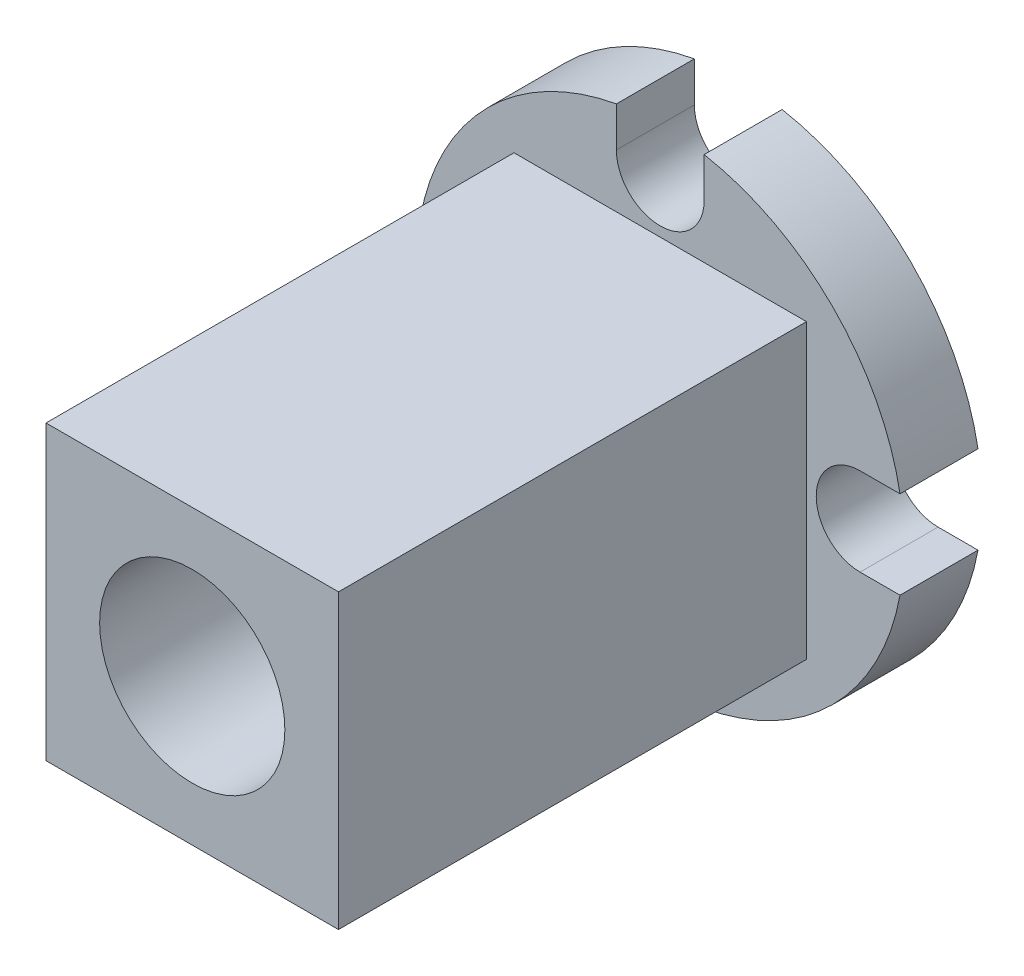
ISO-10303-21;
HEADER;
FILE_DESCRIPTION(('STEP AP214'),'2;1');
FILE_NAME('part.step','',(''),(''),'','','');
FILE_SCHEMA(('AUTOMOTIVE_DESIGN { 1 0 10303 214 1 1 1 1 }'));
ENDSEC;
DATA;
#1=APPLICATION_CONTEXT('core data for automotive mechanical design processes');
#2=APPLICATION_PROTOCOL_DEFINITION('international standard','automotive_design',2000,#1);
#3=PRODUCT_CONTEXT('',#1,'mechanical');
#4=PRODUCT('Part','Part','',(#3));
#5=PRODUCT_RELATED_PRODUCT_CATEGORY('part','',(#4));
#6=PRODUCT_DEFINITION_FORMATION('','',#4);
#7=PRODUCT_DEFINITION_CONTEXT('part definition',#1,'design');
#8=PRODUCT_DEFINITION('design','',#6,#7);
#9=PRODUCT_DEFINITION_SHAPE('','',#8);
#10=(LENGTH_UNIT() NAMED_UNIT(*) SI_UNIT(.MILLI.,.METRE.));
#11=(NAMED_UNIT(*) PLANE_ANGLE_UNIT() SI_UNIT($,.RADIAN.));
#12=(NAMED_UNIT(*) SI_UNIT($,.STERADIAN.) SOLID_ANGLE_UNIT());
#13=UNCERTAINTY_MEASURE_WITH_UNIT(LENGTH_MEASURE(1.E-05),#10,'distance_accuracy_value','');
#14=(GEOMETRIC_REPRESENTATION_CONTEXT(3) GLOBAL_UNCERTAINTY_ASSIGNED_CONTEXT((#13)) GLOBAL_UNIT_ASSIGNED_CONTEXT((#10,
#11,#12)) REPRESENTATION_CONTEXT('',''));
#15=CARTESIAN_POINT('',(0.,0.,0.));
#16=DIRECTION('',(0.,0.,1.));
#17=DIRECTION('',(1.,0.,0.));
#18=AXIS2_PLACEMENT_3D('',#15,#16,#17);
#19=CARTESIAN_POINT('',(-15.,15.,56.));
#20=DIRECTION('',(0.,0.,1.));
#21=DIRECTION('',(0.,-1.,0.));
#22=AXIS2_PLACEMENT_3D('',#19,#20,#21);
#23=PLANE('',#22);
#24=DIRECTION('',(-1.,0.,0.));
#25=VECTOR('',#24,1.);
#26=CARTESIAN_POINT('',(15.,15.,56.));
#27=LINE('',#26,#25);
#28=CARTESIAN_POINT('',(15.,15.,56.));
#29=VERTEX_POINT('',#28);
#30=CARTESIAN_POINT('',(-15.,15.,56.));
#31=VERTEX_POINT('',#30);
#32=EDGE_CURVE('E406',#29,#31,#27,.T.);
#33=ORIENTED_EDGE('',*,*,#32,.T.);
#34=DIRECTION('',(0.,-1.,0.));
#35=VECTOR('',#34,1.);
#36=CARTESIAN_POINT('',(-15.,15.,56.));
#37=LINE('',#36,#35);
#38=CARTESIAN_POINT('',(-15.,-15.,56.));
#39=VERTEX_POINT('',#38);
#40=EDGE_CURVE('E421',#31,#39,#37,.T.);
#41=ORIENTED_EDGE('',*,*,#40,.T.);
#42=DIRECTION('',(1.,0.,0.));
#43=VECTOR('',#42,1.);
#44=CARTESIAN_POINT('',(15.,-15.,56.));
#45=LINE('',#44,#43);
#46=CARTESIAN_POINT('',(15.,-15.,56.));
#47=VERTEX_POINT('',#46);
#48=EDGE_CURVE('E418',#39,#47,#45,.T.);
#49=ORIENTED_EDGE('',*,*,#48,.T.);
#50=DIRECTION('',(0.,1.,0.));
#51=VECTOR('',#50,1.);
#52=CARTESIAN_POINT('',(15.,15.,56.));
#53=LINE('',#52,#51);
#54=EDGE_CURVE('E403',#47,#29,#53,.T.);
#55=ORIENTED_EDGE('',*,*,#54,.T.);
#56=EDGE_LOOP('',(#33,#41,#49,#55));
#57=FACE_BOUND('',#56,.T.);
#58=CARTESIAN_POINT('',(0.,0.,56.));
#59=DIRECTION('',(0.,0.,1.));
#60=DIRECTION('',(1.,0.,0.));
#61=AXIS2_PLACEMENT_3D('',#58,#59,#60);
#62=CIRCLE('',#61,9.5);
#63=CARTESIAN_POINT('',(9.5,0.,56.));
#64=VERTEX_POINT('',#63);
#65=EDGE_CURVE('E415',#64,#64,#62,.T.);
#66=ORIENTED_EDGE('',*,*,#65,.F.);
#67=EDGE_LOOP('',(#66));
#68=FACE_BOUND('',#67,.T.);
#69=ADVANCED_FACE('F14',(#57,#68),#23,.T.);
#70=CARTESIAN_POINT('',(0.,0.,8.));
#71=DIRECTION('',(0.,0.,1.));
#72=DIRECTION('',(0.,-1.,0.));
#73=AXIS2_PLACEMENT_3D('',#70,#71,#72);
#74=PLANE('',#73);
#75=CARTESIAN_POINT('',(0.,0.,8.));
#76=DIRECTION('',(0.,0.,1.));
#77=DIRECTION('',(0.,-1.,0.));
#78=AXIS2_PLACEMENT_3D('',#75,#76,#77);
#79=CIRCLE('',#78,25.);
#80=CARTESIAN_POINT('',(24.5916652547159,4.49999999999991,8.));
#81=VERTEX_POINT('',#80);
#82=CARTESIAN_POINT('',(4.5,24.5916652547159,8.));
#83=VERTEX_POINT('',#82);
#84=EDGE_CURVE('E205',#81,#83,#79,.T.);
#85=ORIENTED_EDGE('',*,*,#84,.T.);
#86=DIRECTION('',(0.,-1.,0.));
#87=VECTOR('',#86,1.);
#88=CARTESIAN_POINT('',(4.5,24.5916652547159,8.));
#89=LINE('',#88,#87);
#90=CARTESIAN_POINT('',(4.5,20.5,8.));
#91=VERTEX_POINT('',#90);
#92=EDGE_CURVE('E104',#83,#91,#89,.T.);
#93=ORIENTED_EDGE('',*,*,#92,.T.);
#94=CARTESIAN_POINT('',(0.,20.5,8.));
#95=DIRECTION('',(0.,0.,-1.));
#96=DIRECTION('',(0.,-1.,0.));
#97=AXIS2_PLACEMENT_3D('',#94,#95,#96);
#98=CIRCLE('',#97,4.5);
#99=CARTESIAN_POINT('',(-4.5,20.5,8.));
#100=VERTEX_POINT('',#99);
#101=EDGE_CURVE('E364',#91,#100,#98,.T.);
#102=ORIENTED_EDGE('',*,*,#101,.T.);
#103=DIRECTION('',(0.,1.,0.));
#104=VECTOR('',#103,1.);
#105=CARTESIAN_POINT('',(-4.5,24.5916652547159,8.));
#106=LINE('',#105,#104);
#107=CARTESIAN_POINT('',(-4.5,24.5916652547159,8.));
#108=VERTEX_POINT('',#107);
#109=EDGE_CURVE('E366',#100,#108,#106,.T.);
#110=ORIENTED_EDGE('',*,*,#109,.T.);
#111=CARTESIAN_POINT('',(0.,0.,8.));
#112=DIRECTION('',(0.,0.,1.));
#113=DIRECTION('',(0.,-1.,0.));
#114=AXIS2_PLACEMENT_3D('',#111,#112,#113);
#115=CIRCLE('',#114,25.);
#116=CARTESIAN_POINT('',(-24.5916652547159,4.50000000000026,8.));
#117=VERTEX_POINT('',#116);
#118=EDGE_CURVE('E368',#108,#117,#115,.T.);
#119=ORIENTED_EDGE('',*,*,#118,.T.);
#120=DIRECTION('',(1.,0.,0.));
#121=VECTOR('',#120,1.);
#122=CARTESIAN_POINT('',(-24.5916652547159,4.50000000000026,8.));
#123=LINE('',#122,#121);
#124=CARTESIAN_POINT('',(-20.5,4.50000000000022,8.));
#125=VERTEX_POINT('',#124);
#126=EDGE_CURVE('E374',#117,#125,#123,.T.);
#127=ORIENTED_EDGE('',*,*,#126,.T.);
#128=CARTESIAN_POINT('',(-20.5,2.14726226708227E-13,8.));
#129=DIRECTION('',(0.,0.,-1.));
#130=DIRECTION('',(0.,-1.,0.));
#131=AXIS2_PLACEMENT_3D('',#128,#129,#130);
#132=CIRCLE('',#131,4.5);
#133=CARTESIAN_POINT('',(-20.5,-4.49999999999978,8.));
#134=VERTEX_POINT('',#133);
#135=EDGE_CURVE('E376',#125,#134,#132,.T.);
#136=ORIENTED_EDGE('',*,*,#135,.T.);
#137=DIRECTION('',(-1.,0.,0.));
#138=VECTOR('',#137,1.);
#139=CARTESIAN_POINT('',(-24.591665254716,-4.49999999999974,8.));
#140=LINE('',#139,#138);
#141=CARTESIAN_POINT('',(-24.591665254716,-4.49999999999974,8.));
#142=VERTEX_POINT('',#141);
#143=EDGE_CURVE('E378',#134,#142,#140,.T.);
#144=ORIENTED_EDGE('',*,*,#143,.T.);
#145=CARTESIAN_POINT('',(0.,0.,8.));
#146=DIRECTION('',(0.,0.,1.));
#147=DIRECTION('',(0.,-1.,0.));
#148=AXIS2_PLACEMENT_3D('',#145,#146,#147);
#149=CIRCLE('',#148,25.);
#150=CARTESIAN_POINT('',(-4.50000000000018,-24.5916652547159,8.));
#151=VERTEX_POINT('',#150);
#152=EDGE_CURVE('E380',#142,#151,#149,.T.);
#153=ORIENTED_EDGE('',*,*,#152,.T.);
#154=DIRECTION('',(0.,1.,0.));
#155=VECTOR('',#154,1.);
#156=CARTESIAN_POINT('',(-4.50000000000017,-24.5916652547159,8.));
#157=LINE('',#156,#155);
#158=CARTESIAN_POINT('',(-4.50000000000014,-20.5,8.));
#159=VERTEX_POINT('',#158);
#160=EDGE_CURVE('E382',#151,#159,#157,.T.);
#161=ORIENTED_EDGE('',*,*,#160,.T.);
#162=CARTESIAN_POINT('',(-1.43150817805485E-13,-20.5,8.));
#163=DIRECTION('',(0.,0.,-1.));
#164=DIRECTION('',(0.,-1.,0.));
#165=AXIS2_PLACEMENT_3D('',#162,#163,#164);
#166=CIRCLE('',#165,4.5);
#167=CARTESIAN_POINT('',(4.49999999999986,-20.5,8.));
#168=VERTEX_POINT('',#167);
#169=EDGE_CURVE('E384',#159,#168,#166,.T.);
#170=ORIENTED_EDGE('',*,*,#169,.T.);
#171=DIRECTION('',(0.,-1.,0.));
#172=VECTOR('',#171,1.);
#173=CARTESIAN_POINT('',(4.49999999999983,-24.5916652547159,8.));
#174=LINE('',#173,#172);
#175=CARTESIAN_POINT('',(4.49999999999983,-24.5916652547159,8.));
#176=VERTEX_POINT('',#175);
#177=EDGE_CURVE('E386',#168,#176,#174,.T.);
#178=ORIENTED_EDGE('',*,*,#177,.T.);
#179=CARTESIAN_POINT('',(0.,0.,8.));
#180=DIRECTION('',(0.,0.,1.));
#181=DIRECTION('',(0.,-1.,0.));
#182=AXIS2_PLACEMENT_3D('',#179,#180,#181);
#183=CIRCLE('',#182,25.);
#184=CARTESIAN_POINT('',(24.5916652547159,-4.50000000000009,8.));
#185=VERTEX_POINT('',#184);
#186=EDGE_CURVE('E152',#176,#185,#183,.T.);
#187=ORIENTED_EDGE('',*,*,#186,.T.);
#188=DIRECTION('',(-1.,0.,0.));
#189=VECTOR('',#188,1.);
#190=CARTESIAN_POINT('',(24.5916652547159,-4.50000000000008,8.));
#191=LINE('',#190,#189);
#192=CARTESIAN_POINT('',(20.5,-4.50000000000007,8.));
#193=VERTEX_POINT('',#192);
#194=EDGE_CURVE('E144',#185,#193,#191,.T.);
#195=ORIENTED_EDGE('',*,*,#194,.T.);
#196=CARTESIAN_POINT('',(20.5,0.,8.));
#197=DIRECTION('',(0.,0.,-1.));
#198=DIRECTION('',(0.,-1.,0.));
#199=AXIS2_PLACEMENT_3D('',#196,#197,#198);
#200=CIRCLE('',#199,4.5);
#201=CARTESIAN_POINT('',(20.5,4.49999999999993,8.));
#202=VERTEX_POINT('',#201);
#203=EDGE_CURVE('E149',#193,#202,#200,.T.);
#204=ORIENTED_EDGE('',*,*,#203,.T.);
#205=DIRECTION('',(1.,0.,0.));
#206=VECTOR('',#205,1.);
#207=CARTESIAN_POINT('',(24.5916652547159,4.49999999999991,8.));
#208=LINE('',#207,#206);
#209=EDGE_CURVE('E38',#202,#81,#208,.T.);
#210=ORIENTED_EDGE('',*,*,#209,.T.);
#211=EDGE_LOOP('',(#85,#93,#102,#110,#119,#127,#136,#144,#153,#161,#170,#178,#187,#195,#204,#210));
#212=FACE_BOUND('',#211,.T.);
#213=DIRECTION('',(0.,-1.,0.));
#214=VECTOR('',#213,1.);
#215=CARTESIAN_POINT('',(-15.,15.,8.));
#216=LINE('',#215,#214);
#217=CARTESIAN_POINT('',(-15.,15.,8.));
#218=VERTEX_POINT('',#217);
#219=CARTESIAN_POINT('',(-15.,-15.,8.));
#220=VERTEX_POINT('',#219);
#221=EDGE_CURVE('E409',#218,#220,#216,.T.);
#222=ORIENTED_EDGE('',*,*,#221,.F.);
#223=DIRECTION('',(-1.,0.,0.));
#224=VECTOR('',#223,1.);
#225=CARTESIAN_POINT('',(15.,15.,8.));
#226=LINE('',#225,#224);
#227=CARTESIAN_POINT('',(15.,15.,8.));
#228=VERTEX_POINT('',#227);
#229=EDGE_CURVE('E412',#228,#218,#226,.T.);
#230=ORIENTED_EDGE('',*,*,#229,.F.);
#231=DIRECTION('',(0.,1.,0.));
#232=VECTOR('',#231,1.);
#233=CARTESIAN_POINT('',(15.,15.,8.));
#234=LINE('',#233,#232);
#235=CARTESIAN_POINT('',(15.,-15.,8.));
#236=VERTEX_POINT('',#235);
#237=EDGE_CURVE('E404',#236,#228,#234,.T.);
#238=ORIENTED_EDGE('',*,*,#237,.F.);
#239=DIRECTION('',(1.,0.,0.));
#240=VECTOR('',#239,1.);
#241=CARTESIAN_POINT('',(15.,-15.,8.));
#242=LINE('',#241,#240);
#243=EDGE_CURVE('E407',#220,#236,#242,.T.);
#244=ORIENTED_EDGE('',*,*,#243,.F.);
#245=EDGE_LOOP('',(#222,#230,#238,#244));
#246=FACE_BOUND('',#245,.T.);
#247=ADVANCED_FACE('F146',(#212,#246),#74,.T.);
#248=CARTESIAN_POINT('',(0.,0.,8.));
#249=DIRECTION('',(0.,0.,-1.));
#250=DIRECTION('',(0.,1.,0.));
#251=AXIS2_PLACEMENT_3D('',#248,#249,#250);
#252=CYLINDRICAL_SURFACE('',#251,25.);
#253=CARTESIAN_POINT('',(0.,0.,0.));
#254=DIRECTION('',(0.,0.,1.));
#255=DIRECTION('',(0.,-1.,0.));
#256=AXIS2_PLACEMENT_3D('',#253,#254,#255);
#257=CIRCLE('',#256,25.);
#258=CARTESIAN_POINT('',(24.5916652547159,4.49999999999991,0.));
#259=VERTEX_POINT('',#258);
#260=CARTESIAN_POINT('',(4.5,24.5916652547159,0.));
#261=VERTEX_POINT('',#260);
#262=EDGE_CURVE('E173',#259,#261,#257,.T.);
#263=ORIENTED_EDGE('',*,*,#262,.T.);
#264=DIRECTION('',(0.,0.,-1.));
#265=VECTOR('',#264,1.);
#266=CARTESIAN_POINT('',(4.5,24.5916652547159,8.));
#267=LINE('',#266,#265);
#268=EDGE_CURVE('E242',#83,#261,#267,.T.);
#269=ORIENTED_EDGE('',*,*,#268,.F.);
#270=ORIENTED_EDGE('',*,*,#84,.F.);
#271=DIRECTION('',(0.,0.,-1.));
#272=VECTOR('',#271,1.);
#273=CARTESIAN_POINT('',(24.5916652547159,4.49999999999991,8.));
#274=LINE('',#273,#272);
#275=EDGE_CURVE('E169',#81,#259,#274,.T.);
#276=ORIENTED_EDGE('',*,*,#275,.T.);
#277=EDGE_LOOP('',(#263,#269,#270,#276));
#278=FACE_BOUND('',#277,.T.);
#279=ADVANCED_FACE('F270',(#278),#252,.T.);
#280=CARTESIAN_POINT('',(4.5,24.5916652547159,8.));
#281=DIRECTION('',(1.,0.,0.));
#282=DIRECTION('',(0.,1.,0.));
#283=AXIS2_PLACEMENT_3D('',#280,#281,#282);
#284=PLANE('',#283);
#285=DIRECTION('',(0.,-1.,0.));
#286=VECTOR('',#285,1.);
#287=CARTESIAN_POINT('',(4.5,24.5916652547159,0.));
#288=LINE('',#287,#286);
#289=CARTESIAN_POINT('',(4.5,20.5,0.));
#290=VERTEX_POINT('',#289);
#291=EDGE_CURVE('E176',#261,#290,#288,.T.);
#292=ORIENTED_EDGE('',*,*,#291,.T.);
#293=DIRECTION('',(0.,0.,-1.));
#294=VECTOR('',#293,1.);
#295=CARTESIAN_POINT('',(4.5,20.5,8.));
#296=LINE('',#295,#294);
#297=EDGE_CURVE('E239',#91,#290,#296,.T.);
#298=ORIENTED_EDGE('',*,*,#297,.F.);
#299=ORIENTED_EDGE('',*,*,#92,.F.);
#300=ORIENTED_EDGE('',*,*,#268,.T.);
#301=EDGE_LOOP('',(#292,#298,#299,#300));
#302=FACE_BOUND('',#301,.T.);
#303=ADVANCED_FACE('F348',(#302),#284,.F.);
#304=CARTESIAN_POINT('',(0.,20.5,8.));
#305=DIRECTION('',(0.,0.,-1.));
#306=DIRECTION('',(0.,1.,0.));
#307=AXIS2_PLACEMENT_3D('',#304,#305,#306);
#308=CYLINDRICAL_SURFACE('',#307,4.5);
#309=CARTESIAN_POINT('',(0.,20.5,0.));
#310=DIRECTION('',(0.,0.,-1.));
#311=DIRECTION('',(0.,-1.,0.));
#312=AXIS2_PLACEMENT_3D('',#309,#310,#311);
#313=CIRCLE('',#312,4.5);
#314=CARTESIAN_POINT('',(-4.5,20.5,0.));
#315=VERTEX_POINT('',#314);
#316=EDGE_CURVE('E179',#290,#315,#313,.T.);
#317=ORIENTED_EDGE('',*,*,#316,.T.);
#318=DIRECTION('',(0.,0.,-1.));
#319=VECTOR('',#318,1.);
#320=CARTESIAN_POINT('',(-4.5,20.5,8.));
#321=LINE('',#320,#319);
#322=EDGE_CURVE('E236',#100,#315,#321,.T.);
#323=ORIENTED_EDGE('',*,*,#322,.F.);
#324=ORIENTED_EDGE('',*,*,#101,.F.);
#325=ORIENTED_EDGE('',*,*,#297,.T.);
#326=EDGE_LOOP('',(#317,#323,#324,#325));
#327=FACE_BOUND('',#326,.T.);
#328=ADVANCED_FACE('F344',(#327),#308,.F.);
#329=CARTESIAN_POINT('',(-4.5,24.5916652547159,8.));
#330=DIRECTION('',(-1.,0.,0.));
#331=DIRECTION('',(0.,0.,-1.));
#332=AXIS2_PLACEMENT_3D('',#329,#330,#331);
#333=PLANE('',#332);
#334=DIRECTION('',(0.,1.,0.));
#335=VECTOR('',#334,1.);
#336=CARTESIAN_POINT('',(-4.5,24.5916652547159,0.));
#337=LINE('',#336,#335);
#338=CARTESIAN_POINT('',(-4.5,24.5916652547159,0.));
#339=VERTEX_POINT('',#338);
#340=EDGE_CURVE('E181',#315,#339,#337,.T.);
#341=ORIENTED_EDGE('',*,*,#340,.T.);
#342=DIRECTION('',(0.,0.,-1.));
#343=VECTOR('',#342,1.);
#344=CARTESIAN_POINT('',(-4.5,24.5916652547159,8.));
#345=LINE('',#344,#343);
#346=EDGE_CURVE('E233',#108,#339,#345,.T.);
#347=ORIENTED_EDGE('',*,*,#346,.F.);
#348=ORIENTED_EDGE('',*,*,#109,.F.);
#349=ORIENTED_EDGE('',*,*,#322,.T.);
#350=EDGE_LOOP('',(#341,#347,#348,#349));
#351=FACE_BOUND('',#350,.T.);
#352=ADVANCED_FACE('F340',(#351),#333,.F.);
#353=CARTESIAN_POINT('',(0.,0.,8.));
#354=DIRECTION('',(0.,0.,-1.));
#355=DIRECTION('',(0.,1.,0.));
#356=AXIS2_PLACEMENT_3D('',#353,#354,#355);
#357=CYLINDRICAL_SURFACE('',#356,25.);
#358=CARTESIAN_POINT('',(0.,0.,0.));
#359=DIRECTION('',(0.,0.,1.));
#360=DIRECTION('',(0.,-1.,0.));
#361=AXIS2_PLACEMENT_3D('',#358,#359,#360);
#362=CIRCLE('',#361,25.);
#363=CARTESIAN_POINT('',(-24.5916652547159,4.50000000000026,0.));
#364=VERTEX_POINT('',#363);
#365=EDGE_CURVE('E183',#339,#364,#362,.T.);
#366=ORIENTED_EDGE('',*,*,#365,.T.);
#367=DIRECTION('',(0.,0.,-1.));
#368=VECTOR('',#367,1.);
#369=CARTESIAN_POINT('',(-24.5916652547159,4.50000000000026,8.));
#370=LINE('',#369,#368);
#371=EDGE_CURVE('E230',#117,#364,#370,.T.);
#372=ORIENTED_EDGE('',*,*,#371,.F.);
#373=ORIENTED_EDGE('',*,*,#118,.F.);
#374=ORIENTED_EDGE('',*,*,#346,.T.);
#375=EDGE_LOOP('',(#366,#372,#373,#374));
#376=FACE_BOUND('',#375,.T.);
#377=ADVANCED_FACE('F336',(#376),#357,.T.);
#378=CARTESIAN_POINT('',(-24.5916652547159,4.50000000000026,8.));
#379=DIRECTION('',(0.,1.,0.));
#380=DIRECTION('',(-1.,0.,0.));
#381=AXIS2_PLACEMENT_3D('',#378,#379,#380);
#382=PLANE('',#381);
#383=DIRECTION('',(1.,0.,0.));
#384=VECTOR('',#383,1.);
#385=CARTESIAN_POINT('',(-24.5916652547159,4.50000000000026,0.));
#386=LINE('',#385,#384);
#387=CARTESIAN_POINT('',(-20.5,4.50000000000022,0.));
#388=VERTEX_POINT('',#387);
#389=EDGE_CURVE('E185',#364,#388,#386,.T.);
#390=ORIENTED_EDGE('',*,*,#389,.T.);
#391=DIRECTION('',(0.,0.,-1.));
#392=VECTOR('',#391,1.);
#393=CARTESIAN_POINT('',(-20.5,4.50000000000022,8.));
#394=LINE('',#393,#392);
#395=EDGE_CURVE('E227',#125,#388,#394,.T.);
#396=ORIENTED_EDGE('',*,*,#395,.F.);
#397=ORIENTED_EDGE('',*,*,#126,.F.);
#398=ORIENTED_EDGE('',*,*,#371,.T.);
#399=EDGE_LOOP('',(#390,#396,#397,#398));
#400=FACE_BOUND('',#399,.T.);
#401=ADVANCED_FACE('F332',(#400),#382,.F.);
#402=CARTESIAN_POINT('',(-20.5,2.14726226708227E-13,8.));
#403=DIRECTION('',(0.,0.,-1.));
#404=DIRECTION('',(0.,1.,0.));
#405=AXIS2_PLACEMENT_3D('',#402,#403,#404);
#406=CYLINDRICAL_SURFACE('',#405,4.5);
#407=CARTESIAN_POINT('',(-20.5,2.14726226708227E-13,0.));
#408=DIRECTION('',(0.,0.,-1.));
#409=DIRECTION('',(0.,-1.,0.));
#410=AXIS2_PLACEMENT_3D('',#407,#408,#409);
#411=CIRCLE('',#410,4.5);
#412=CARTESIAN_POINT('',(-20.5,-4.49999999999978,0.));
#413=VERTEX_POINT('',#412);
#414=EDGE_CURVE('E187',#388,#413,#411,.T.);
#415=ORIENTED_EDGE('',*,*,#414,.T.);
#416=DIRECTION('',(0.,0.,-1.));
#417=VECTOR('',#416,1.);
#418=CARTESIAN_POINT('',(-20.5,-4.49999999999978,8.));
#419=LINE('',#418,#417);
#420=EDGE_CURVE('E224',#134,#413,#419,.T.);
#421=ORIENTED_EDGE('',*,*,#420,.F.);
#422=ORIENTED_EDGE('',*,*,#135,.F.);
#423=ORIENTED_EDGE('',*,*,#395,.T.);
#424=EDGE_LOOP('',(#415,#421,#422,#423));
#425=FACE_BOUND('',#424,.T.);
#426=ADVANCED_FACE('F328',(#425),#406,.F.);
#427=CARTESIAN_POINT('',(-24.591665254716,-4.49999999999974,8.));
#428=DIRECTION('',(0.,-1.,0.));
#429=DIRECTION('',(1.,0.,0.));
#430=AXIS2_PLACEMENT_3D('',#427,#428,#429);
#431=PLANE('',#430);
#432=DIRECTION('',(-1.,0.,0.));
#433=VECTOR('',#432,1.);
#434=CARTESIAN_POINT('',(-24.591665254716,-4.49999999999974,0.));
#435=LINE('',#434,#433);
#436=CARTESIAN_POINT('',(-24.591665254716,-4.49999999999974,0.));
#437=VERTEX_POINT('',#436);
#438=EDGE_CURVE('E189',#413,#437,#435,.T.);
#439=ORIENTED_EDGE('',*,*,#438,.T.);
#440=DIRECTION('',(0.,0.,-1.));
#441=VECTOR('',#440,1.);
#442=CARTESIAN_POINT('',(-24.591665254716,-4.49999999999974,8.));
#443=LINE('',#442,#441);
#444=EDGE_CURVE('E221',#142,#437,#443,.T.);
#445=ORIENTED_EDGE('',*,*,#444,.F.);
#446=ORIENTED_EDGE('',*,*,#143,.F.);
#447=ORIENTED_EDGE('',*,*,#420,.T.);
#448=EDGE_LOOP('',(#439,#445,#446,#447));
#449=FACE_BOUND('',#448,.T.);
#450=ADVANCED_FACE('F324',(#449),#431,.F.);
#451=CARTESIAN_POINT('',(0.,0.,8.));
#452=DIRECTION('',(0.,0.,-1.));
#453=DIRECTION('',(0.,1.,0.));
#454=AXIS2_PLACEMENT_3D('',#451,#452,#453);
#455=CYLINDRICAL_SURFACE('',#454,25.);
#456=CARTESIAN_POINT('',(0.,0.,0.));
#457=DIRECTION('',(0.,0.,1.));
#458=DIRECTION('',(0.,-1.,0.));
#459=AXIS2_PLACEMENT_3D('',#456,#457,#458);
#460=CIRCLE('',#459,25.);
#461=CARTESIAN_POINT('',(-4.50000000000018,-24.5916652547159,0.));
#462=VERTEX_POINT('',#461);
#463=EDGE_CURVE('E191',#437,#462,#460,.T.);
#464=ORIENTED_EDGE('',*,*,#463,.T.);
#465=DIRECTION('',(0.,0.,-1.));
#466=VECTOR('',#465,1.);
#467=CARTESIAN_POINT('',(-4.50000000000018,-24.5916652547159,8.));
#468=LINE('',#467,#466);
#469=EDGE_CURVE('E218',#151,#462,#468,.T.);
#470=ORIENTED_EDGE('',*,*,#469,.F.);
#471=ORIENTED_EDGE('',*,*,#152,.F.);
#472=ORIENTED_EDGE('',*,*,#444,.T.);
#473=EDGE_LOOP('',(#464,#470,#471,#472));
#474=FACE_BOUND('',#473,.T.);
#475=ADVANCED_FACE('F320',(#474),#455,.T.);
#476=CARTESIAN_POINT('',(-4.50000000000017,-24.5916652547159,8.));
#477=DIRECTION('',(-1.,0.,0.));
#478=DIRECTION('',(0.,-1.,0.));
#479=AXIS2_PLACEMENT_3D('',#476,#477,#478);
#480=PLANE('',#479);
#481=DIRECTION('',(0.,1.,0.));
#482=VECTOR('',#481,1.);
#483=CARTESIAN_POINT('',(-4.50000000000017,-24.5916652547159,0.));
#484=LINE('',#483,#482);
#485=CARTESIAN_POINT('',(-4.50000000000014,-20.5,0.));
#486=VERTEX_POINT('',#485);
#487=EDGE_CURVE('E193',#462,#486,#484,.T.);
#488=ORIENTED_EDGE('',*,*,#487,.T.);
#489=DIRECTION('',(0.,0.,-1.));
#490=VECTOR('',#489,1.);
#491=CARTESIAN_POINT('',(-4.50000000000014,-20.5,8.));
#492=LINE('',#491,#490);
#493=EDGE_CURVE('E215',#159,#486,#492,.T.);
#494=ORIENTED_EDGE('',*,*,#493,.F.);
#495=ORIENTED_EDGE('',*,*,#160,.F.);
#496=ORIENTED_EDGE('',*,*,#469,.T.);
#497=EDGE_LOOP('',(#488,#494,#495,#496));
#498=FACE_BOUND('',#497,.T.);
#499=ADVANCED_FACE('F316',(#498),#480,.F.);
#500=CARTESIAN_POINT('',(-1.43150817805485E-13,-20.5,8.));
#501=DIRECTION('',(0.,0.,-1.));
#502=DIRECTION('',(0.,1.,0.));
#503=AXIS2_PLACEMENT_3D('',#500,#501,#502);
#504=CYLINDRICAL_SURFACE('',#503,4.5);
#505=CARTESIAN_POINT('',(-1.43150817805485E-13,-20.5,0.));
#506=DIRECTION('',(0.,0.,-1.));
#507=DIRECTION('',(0.,-1.,0.));
#508=AXIS2_PLACEMENT_3D('',#505,#506,#507);
#509=CIRCLE('',#508,4.5);
#510=CARTESIAN_POINT('',(4.49999999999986,-20.5,0.));
#511=VERTEX_POINT('',#510);
#512=EDGE_CURVE('E195',#486,#511,#509,.T.);
#513=ORIENTED_EDGE('',*,*,#512,.T.);
#514=DIRECTION('',(0.,0.,-1.));
#515=VECTOR('',#514,1.);
#516=CARTESIAN_POINT('',(4.49999999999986,-20.5,8.));
#517=LINE('',#516,#515);
#518=EDGE_CURVE('E212',#168,#511,#517,.T.);
#519=ORIENTED_EDGE('',*,*,#518,.F.);
#520=ORIENTED_EDGE('',*,*,#169,.F.);
#521=ORIENTED_EDGE('',*,*,#493,.T.);
#522=EDGE_LOOP('',(#513,#519,#520,#521));
#523=FACE_BOUND('',#522,.T.);
#524=ADVANCED_FACE('F312',(#523),#504,.F.);
#525=CARTESIAN_POINT('',(4.49999999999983,-24.5916652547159,8.));
#526=DIRECTION('',(1.,0.,0.));
#527=DIRECTION('',(0.,1.,0.));
#528=AXIS2_PLACEMENT_3D('',#525,#526,#527);
#529=PLANE('',#528);
#530=DIRECTION('',(0.,-1.,0.));
#531=VECTOR('',#530,1.);
#532=CARTESIAN_POINT('',(4.49999999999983,-24.5916652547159,0.));
#533=LINE('',#532,#531);
#534=CARTESIAN_POINT('',(4.49999999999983,-24.5916652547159,0.));
#535=VERTEX_POINT('',#534);
#536=EDGE_CURVE('E197',#511,#535,#533,.T.);
#537=ORIENTED_EDGE('',*,*,#536,.T.);
#538=DIRECTION('',(0.,0.,-1.));
#539=VECTOR('',#538,1.);
#540=CARTESIAN_POINT('',(4.49999999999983,-24.5916652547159,8.));
#541=LINE('',#540,#539);
#542=EDGE_CURVE('E209',#176,#535,#541,.T.);
#543=ORIENTED_EDGE('',*,*,#542,.F.);
#544=ORIENTED_EDGE('',*,*,#177,.F.);
#545=ORIENTED_EDGE('',*,*,#518,.T.);
#546=EDGE_LOOP('',(#537,#543,#544,#545));
#547=FACE_BOUND('',#546,.T.);
#548=ADVANCED_FACE('F308',(#547),#529,.F.);
#549=CARTESIAN_POINT('',(0.,0.,8.));
#550=DIRECTION('',(0.,0.,-1.));
#551=DIRECTION('',(0.,1.,0.));
#552=AXIS2_PLACEMENT_3D('',#549,#550,#551);
#553=CYLINDRICAL_SURFACE('',#552,25.);
#554=CARTESIAN_POINT('',(0.,0.,0.));
#555=DIRECTION('',(0.,0.,1.));
#556=DIRECTION('',(0.,-1.,0.));
#557=AXIS2_PLACEMENT_3D('',#554,#555,#556);
#558=CIRCLE('',#557,25.);
#559=CARTESIAN_POINT('',(24.5916652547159,-4.50000000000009,0.));
#560=VERTEX_POINT('',#559);
#561=EDGE_CURVE('E199',#535,#560,#558,.T.);
#562=ORIENTED_EDGE('',*,*,#561,.T.);
#563=DIRECTION('',(0.,0.,-1.));
#564=VECTOR('',#563,1.);
#565=CARTESIAN_POINT('',(24.5916652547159,-4.50000000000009,8.));
#566=LINE('',#565,#564);
#567=EDGE_CURVE('E164',#185,#560,#566,.T.);
#568=ORIENTED_EDGE('',*,*,#567,.F.);
#569=ORIENTED_EDGE('',*,*,#186,.F.);
#570=ORIENTED_EDGE('',*,*,#542,.T.);
#571=EDGE_LOOP('',(#562,#568,#569,#570));
#572=FACE_BOUND('',#571,.T.);
#573=ADVANCED_FACE('F305',(#572),#553,.T.);
#574=CARTESIAN_POINT('',(24.5916652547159,-4.50000000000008,8.));
#575=DIRECTION('',(0.,-1.,0.));
#576=DIRECTION('',(1.,0.,0.));
#577=AXIS2_PLACEMENT_3D('',#574,#575,#576);
#578=PLANE('',#577);
#579=DIRECTION('',(-1.,0.,0.));
#580=VECTOR('',#579,1.);
#581=CARTESIAN_POINT('',(24.5916652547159,-4.50000000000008,0.));
#582=LINE('',#581,#580);
#583=CARTESIAN_POINT('',(20.5,-4.50000000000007,0.));
#584=VERTEX_POINT('',#583);
#585=EDGE_CURVE('E161',#560,#584,#582,.T.);
#586=ORIENTED_EDGE('',*,*,#585,.T.);
#587=DIRECTION('',(0.,0.,-1.));
#588=VECTOR('',#587,1.);
#589=CARTESIAN_POINT('',(20.5,-4.50000000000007,8.));
#590=LINE('',#589,#588);
#591=EDGE_CURVE('E158',#193,#584,#590,.T.);
#592=ORIENTED_EDGE('',*,*,#591,.F.);
#593=ORIENTED_EDGE('',*,*,#194,.F.);
#594=ORIENTED_EDGE('',*,*,#567,.T.);
#595=EDGE_LOOP('',(#586,#592,#593,#594));
#596=FACE_BOUND('',#595,.T.);
#597=ADVANCED_FACE('F159',(#596),#578,.F.);
#598=CARTESIAN_POINT('',(20.5,0.,8.));
#599=DIRECTION('',(0.,0.,-1.));
#600=DIRECTION('',(0.,1.,0.));
#601=AXIS2_PLACEMENT_3D('',#598,#599,#600);
#602=CYLINDRICAL_SURFACE('',#601,4.5);
#603=CARTESIAN_POINT('',(20.5,0.,0.));
#604=DIRECTION('',(0.,0.,-1.));
#605=DIRECTION('',(0.,-1.,0.));
#606=AXIS2_PLACEMENT_3D('',#603,#604,#605);
#607=CIRCLE('',#606,4.5);
#608=CARTESIAN_POINT('',(20.5,4.49999999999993,0.));
#609=VERTEX_POINT('',#608);
#610=EDGE_CURVE('E202',#584,#609,#607,.T.);
#611=ORIENTED_EDGE('',*,*,#610,.T.);
#612=DIRECTION('',(0.,0.,-1.));
#613=VECTOR('',#612,1.);
#614=CARTESIAN_POINT('',(20.5,4.49999999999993,8.));
#615=LINE('',#614,#613);
#616=EDGE_CURVE('E165',#202,#609,#615,.T.);
#617=ORIENTED_EDGE('',*,*,#616,.F.);
#618=ORIENTED_EDGE('',*,*,#203,.F.);
#619=ORIENTED_EDGE('',*,*,#591,.T.);
#620=EDGE_LOOP('',(#611,#617,#618,#619));
#621=FACE_BOUND('',#620,.T.);
#622=ADVANCED_FACE('F167',(#621),#602,.F.);
#623=CARTESIAN_POINT('',(24.5916652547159,4.49999999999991,8.));
#624=DIRECTION('',(0.,1.,0.));
#625=DIRECTION('',(-1.,0.,0.));
#626=AXIS2_PLACEMENT_3D('',#623,#624,#625);
#627=PLANE('',#626);
#628=DIRECTION('',(1.,0.,0.));
#629=VECTOR('',#628,1.);
#630=CARTESIAN_POINT('',(24.5916652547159,4.49999999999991,0.));
#631=LINE('',#630,#629);
#632=EDGE_CURVE('E95',#609,#259,#631,.T.);
#633=ORIENTED_EDGE('',*,*,#632,.T.);
#634=ORIENTED_EDGE('',*,*,#275,.F.);
#635=ORIENTED_EDGE('',*,*,#209,.F.);
#636=ORIENTED_EDGE('',*,*,#616,.T.);
#637=EDGE_LOOP('',(#633,#634,#635,#636));
#638=FACE_BOUND('',#637,.T.);
#639=ADVANCED_FACE('F297',(#638),#627,.F.);
#640=CARTESIAN_POINT('',(0.,0.,0.));
#641=DIRECTION('',(0.,0.,1.));
#642=DIRECTION('',(0.,-1.,0.));
#643=AXIS2_PLACEMENT_3D('',#640,#641,#642);
#644=PLANE('',#643);
#645=CARTESIAN_POINT('',(0.,0.,0.));
#646=DIRECTION('',(0.,0.,1.));
#647=DIRECTION('',(1.,0.,0.));
#648=AXIS2_PLACEMENT_3D('',#645,#646,#647);
#649=CIRCLE('',#648,4.5);
#650=CARTESIAN_POINT('',(4.5,0.,0.));
#651=VERTEX_POINT('',#650);
#652=EDGE_CURVE('E9',#651,#651,#649,.T.);
#653=ORIENTED_EDGE('',*,*,#652,.T.);
#654=EDGE_LOOP('',(#653));
#655=FACE_BOUND('',#654,.T.);
#656=ORIENTED_EDGE('',*,*,#262,.F.);
#657=ORIENTED_EDGE('',*,*,#632,.F.);
#658=ORIENTED_EDGE('',*,*,#610,.F.);
#659=ORIENTED_EDGE('',*,*,#585,.F.);
#660=ORIENTED_EDGE('',*,*,#561,.F.);
#661=ORIENTED_EDGE('',*,*,#536,.F.);
#662=ORIENTED_EDGE('',*,*,#512,.F.);
#663=ORIENTED_EDGE('',*,*,#487,.F.);
#664=ORIENTED_EDGE('',*,*,#463,.F.);
#665=ORIENTED_EDGE('',*,*,#438,.F.);
#666=ORIENTED_EDGE('',*,*,#414,.F.);
#667=ORIENTED_EDGE('',*,*,#389,.F.);
#668=ORIENTED_EDGE('',*,*,#365,.F.);
#669=ORIENTED_EDGE('',*,*,#340,.F.);
#670=ORIENTED_EDGE('',*,*,#316,.F.);
#671=ORIENTED_EDGE('',*,*,#291,.F.);
#672=EDGE_LOOP('',(#656,#657,#658,#659,#660,#661,#662,#663,#664,#665,#666,#667,#668,#669,#670,#671));
#673=FACE_BOUND('',#672,.T.);
#674=ADVANCED_FACE('F292',(#655,#673),#644,.F.);
#675=CARTESIAN_POINT('',(15.,15.,56.));
#676=DIRECTION('',(0.,-1.,0.));
#677=DIRECTION('',(1.,0.,0.));
#678=AXIS2_PLACEMENT_3D('',#675,#676,#677);
#679=PLANE('',#678);
#680=ORIENTED_EDGE('',*,*,#229,.T.);
#681=DIRECTION('',(0.,0.,-1.));
#682=VECTOR('',#681,1.);
#683=CARTESIAN_POINT('',(-15.,15.,56.));
#684=LINE('',#683,#682);
#685=EDGE_CURVE('E177',#31,#218,#684,.T.);
#686=ORIENTED_EDGE('',*,*,#685,.F.);
#687=ORIENTED_EDGE('',*,*,#32,.F.);
#688=DIRECTION('',(0.,0.,-1.));
#689=VECTOR('',#688,1.);
#690=CARTESIAN_POINT('',(15.,15.,56.));
#691=LINE('',#690,#689);
#692=EDGE_CURVE('E400',#29,#228,#691,.T.);
#693=ORIENTED_EDGE('',*,*,#692,.T.);
#694=EDGE_LOOP('',(#680,#686,#687,#693));
#695=FACE_BOUND('',#694,.T.);
#696=ADVANCED_FACE('F289',(#695),#679,.F.);
#697=CARTESIAN_POINT('',(-15.,15.,56.));
#698=DIRECTION('',(1.,0.,0.));
#699=DIRECTION('',(0.,0.,1.));
#700=AXIS2_PLACEMENT_3D('',#697,#698,#699);
#701=PLANE('',#700);
#702=ORIENTED_EDGE('',*,*,#221,.T.);
#703=DIRECTION('',(0.,0.,-1.));
#704=VECTOR('',#703,1.);
#705=CARTESIAN_POINT('',(-15.,-15.,56.));
#706=LINE('',#705,#704);
#707=EDGE_CURVE('E396',#39,#220,#706,.T.);
#708=ORIENTED_EDGE('',*,*,#707,.F.);
#709=ORIENTED_EDGE('',*,*,#40,.F.);
#710=ORIENTED_EDGE('',*,*,#685,.T.);
#711=EDGE_LOOP('',(#702,#708,#709,#710));
#712=FACE_BOUND('',#711,.T.);
#713=ADVANCED_FACE('F285',(#712),#701,.F.);
#714=CARTESIAN_POINT('',(15.,-15.,56.));
#715=DIRECTION('',(0.,1.,0.));
#716=DIRECTION('',(-1.,0.,0.));
#717=AXIS2_PLACEMENT_3D('',#714,#715,#716);
#718=PLANE('',#717);
#719=ORIENTED_EDGE('',*,*,#243,.T.);
#720=DIRECTION('',(0.,0.,-1.));
#721=VECTOR('',#720,1.);
#722=CARTESIAN_POINT('',(15.,-15.,56.));
#723=LINE('',#722,#721);
#724=EDGE_CURVE('E29',#47,#236,#723,.T.);
#725=ORIENTED_EDGE('',*,*,#724,.F.);
#726=ORIENTED_EDGE('',*,*,#48,.F.);
#727=ORIENTED_EDGE('',*,*,#707,.T.);
#728=EDGE_LOOP('',(#719,#725,#726,#727));
#729=FACE_BOUND('',#728,.T.);
#730=ADVANCED_FACE('F282',(#729),#718,.F.);
#731=CARTESIAN_POINT('',(15.,15.,56.));
#732=DIRECTION('',(-1.,0.,0.));
#733=DIRECTION('',(0.,0.,-1.));
#734=AXIS2_PLACEMENT_3D('',#731,#732,#733);
#735=PLANE('',#734);
#736=ORIENTED_EDGE('',*,*,#237,.T.);
#737=ORIENTED_EDGE('',*,*,#692,.F.);
#738=ORIENTED_EDGE('',*,*,#54,.F.);
#739=ORIENTED_EDGE('',*,*,#724,.T.);
#740=EDGE_LOOP('',(#736,#737,#738,#739));
#741=FACE_BOUND('',#740,.T.);
#742=ADVANCED_FACE('F278',(#741),#735,.F.);
#743=CARTESIAN_POINT('',(0.,0.,56.));
#744=DIRECTION('',(0.,0.,-1.));
#745=DIRECTION('',(-1.,0.,0.));
#746=AXIS2_PLACEMENT_3D('',#743,#744,#745);
#747=CYLINDRICAL_SURFACE('',#746,9.5);
#748=ORIENTED_EDGE('',*,*,#65,.T.);
#749=EDGE_LOOP('',(#748));
#750=FACE_BOUND('',#749,.T.);
#751=CARTESIAN_POINT('',(0.,0.,36.));
#752=DIRECTION('',(0.,0.,1.));
#753=DIRECTION('',(1.,0.,0.));
#754=AXIS2_PLACEMENT_3D('',#751,#752,#753);
#755=CIRCLE('',#754,9.5);
#756=CARTESIAN_POINT('',(9.5,0.,36.));
#757=VERTEX_POINT('',#756);
#758=EDGE_CURVE('E244',#757,#757,#755,.F.);
#759=ORIENTED_EDGE('',*,*,#758,.T.);
#760=EDGE_LOOP('',(#759));
#761=FACE_BOUND('',#760,.T.);
#762=ADVANCED_FACE('F281',(#750,#761),#747,.F.);
#763=CARTESIAN_POINT('',(0.,0.,36.));
#764=DIRECTION('',(0.,0.,1.));
#765=DIRECTION('',(1.,0.,0.));
#766=AXIS2_PLACEMENT_3D('',#763,#764,#765);
#767=PLANE('',#766);
#768=ORIENTED_EDGE('',*,*,#758,.F.);
#769=EDGE_LOOP('',(#768));
#770=FACE_BOUND('',#769,.T.);
#771=ADVANCED_FACE('F276',(#770),#767,.T.);
#772=CARTESIAN_POINT('',(0.,0.,25.));
#773=DIRECTION('',(0.,0.,-1.));
#774=DIRECTION('',(-1.,0.,0.));
#775=AXIS2_PLACEMENT_3D('',#772,#773,#774);
#776=CYLINDRICAL_SURFACE('',#775,4.);
#777=CARTESIAN_POINT('',(0.,0.,0.500000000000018));
#778=DIRECTION('',(0.,0.,1.));
#779=DIRECTION('',(1.,0.,0.));
#780=AXIS2_PLACEMENT_3D('',#777,#778,#779);
#781=CIRCLE('',#780,4.);
#782=CARTESIAN_POINT('',(4.,0.,0.500000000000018));
#783=VERTEX_POINT('',#782);
#784=EDGE_CURVE('E22',#783,#783,#781,.F.);
#785=ORIENTED_EDGE('',*,*,#784,.T.);
#786=EDGE_LOOP('',(#785));
#787=FACE_BOUND('',#786,.T.);
#788=CARTESIAN_POINT('',(0.,0.,25.));
#789=DIRECTION('',(0.,0.,-1.));
#790=DIRECTION('',(-1.,0.,0.));
#791=AXIS2_PLACEMENT_3D('',#788,#789,#790);
#792=CIRCLE('',#791,4.);
#793=CARTESIAN_POINT('',(-4.,0.,25.));
#794=VERTEX_POINT('',#793);
#795=EDGE_CURVE('E427',#794,#794,#792,.T.);
#796=ORIENTED_EDGE('',*,*,#795,.F.);
#797=EDGE_LOOP('',(#796));
#798=FACE_BOUND('',#797,.T.);
#799=ADVANCED_FACE('F249',(#787,#798),#776,.F.);
#800=CARTESIAN_POINT('',(0.,0.,25.));
#801=DIRECTION('',(0.,0.,-1.));
#802=DIRECTION('',(-1.,0.,0.));
#803=AXIS2_PLACEMENT_3D('',#800,#801,#802);
#804=PLANE('',#803);
#805=ORIENTED_EDGE('',*,*,#795,.T.);
#806=EDGE_LOOP('',(#805));
#807=FACE_BOUND('',#806,.T.);
#808=ADVANCED_FACE('F253',(#807),#804,.T.);
#809=CARTESIAN_POINT('',(0.,0.,0.500000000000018));
#810=DIRECTION('',(0.,0.,-1.));
#811=DIRECTION('',(-1.,0.,0.));
#812=AXIS2_PLACEMENT_3D('',#809,#810,#811);
#813=CONICAL_SURFACE('',#812,4.,0.785398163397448);
#814=ORIENTED_EDGE('',*,*,#652,.F.);
#815=EDGE_LOOP('',(#814));
#816=FACE_BOUND('',#815,.T.);
#817=ORIENTED_EDGE('',*,*,#784,.F.);
#818=EDGE_LOOP('',(#817));
#819=FACE_BOUND('',#818,.T.);
#820=ADVANCED_FACE('F16',(#816,#819),#813,.F.);
#821=CLOSED_SHELL('',(#69,#247,#279,#303,#328,#352,#377,#401,#426,#450,#475,#499,#524,#548,#573,
#597,#622,#639,#674,#696,#713,#730,#742,#762,#771,#799,#808,#820));
#822=MANIFOLD_SOLID_BREP('B1',#821);
#823=ADVANCED_BREP_SHAPE_REPRESENTATION('',(#18,#822),#14);
#824=SHAPE_DEFINITION_REPRESENTATION(#9,#823);
ENDSEC;
END-ISO-10303-21;
